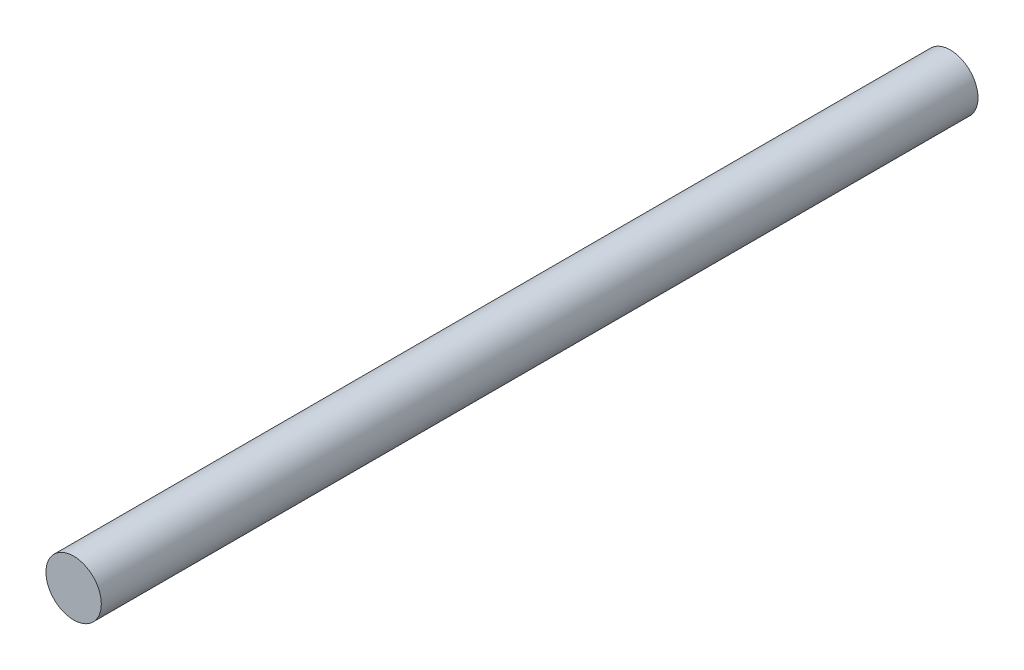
from build123d import *

# Parameters (mm, degrees)
SKETCH1_R      = 3
EXTRUDE1_DEPTH = 95


with BuildPart() as part:
    # Sketch1 → Extrude1 (new body)
    with BuildSketch(Plane.XY):
        Circle(SKETCH1_R)
    extrude(amount=EXTRUDE1_DEPTH)


solid = part.part
